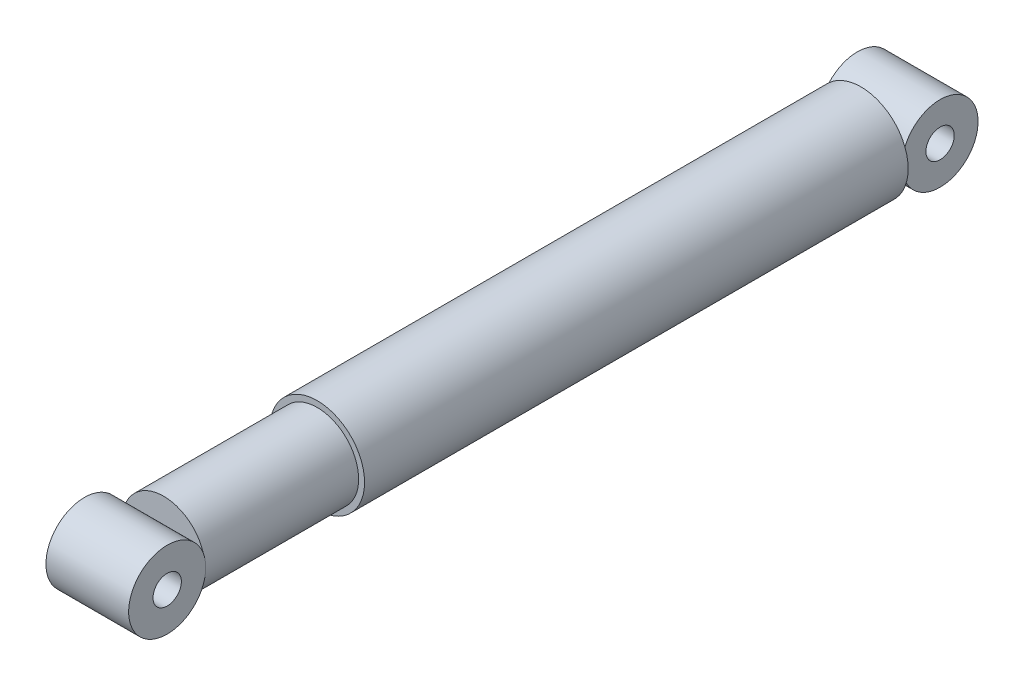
ISO-10303-21;
HEADER;
FILE_DESCRIPTION(('STEP AP214'),'2;1');
FILE_NAME('part.step','',(''),(''),'','','');
FILE_SCHEMA(('AUTOMOTIVE_DESIGN { 1 0 10303 214 1 1 1 1 }'));
ENDSEC;
DATA;
#1=APPLICATION_CONTEXT('core data for automotive mechanical design processes');
#2=APPLICATION_PROTOCOL_DEFINITION('international standard','automotive_design',2000,#1);
#3=PRODUCT_CONTEXT('',#1,'mechanical');
#4=PRODUCT('Part','Part','',(#3));
#5=PRODUCT_RELATED_PRODUCT_CATEGORY('part','',(#4));
#6=PRODUCT_DEFINITION_FORMATION('','',#4);
#7=PRODUCT_DEFINITION_CONTEXT('part definition',#1,'design');
#8=PRODUCT_DEFINITION('design','',#6,#7);
#9=PRODUCT_DEFINITION_SHAPE('','',#8);
#10=(LENGTH_UNIT() NAMED_UNIT(*) SI_UNIT(.MILLI.,.METRE.));
#11=(NAMED_UNIT(*) PLANE_ANGLE_UNIT() SI_UNIT($,.RADIAN.));
#12=(NAMED_UNIT(*) SI_UNIT($,.STERADIAN.) SOLID_ANGLE_UNIT());
#13=UNCERTAINTY_MEASURE_WITH_UNIT(LENGTH_MEASURE(1.E-05),#10,'distance_accuracy_value','');
#14=(GEOMETRIC_REPRESENTATION_CONTEXT(3) GLOBAL_UNCERTAINTY_ASSIGNED_CONTEXT((#13)) GLOBAL_UNIT_ASSIGNED_CONTEXT((#10,
#11,#12)) REPRESENTATION_CONTEXT('',''));
#15=CARTESIAN_POINT('',(0.,0.,0.));
#16=DIRECTION('',(0.,0.,1.));
#17=DIRECTION('',(1.,0.,0.));
#18=AXIS2_PLACEMENT_3D('',#15,#16,#17);
#19=CARTESIAN_POINT('',(0.,0.,295.));
#20=DIRECTION('',(0.,0.,-1.));
#21=DIRECTION('',(-1.,0.,0.));
#22=AXIS2_PLACEMENT_3D('',#19,#20,#21);
#23=PLANE('',#22);
#24=CARTESIAN_POINT('',(0.,0.,295.));
#25=DIRECTION('',(0.,0.,-1.));
#26=DIRECTION('',(-1.,0.,0.));
#27=AXIS2_PLACEMENT_3D('',#24,#25,#26);
#28=CIRCLE('',#27,17.5);
#29=CARTESIAN_POINT('',(17.2111256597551,-3.16656809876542,295.));
#30=VERTEX_POINT('',#29);
#31=CARTESIAN_POINT('',(-17.2111256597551,-3.16656809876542,295.));
#32=VERTEX_POINT('',#31);
#33=EDGE_CURVE('E139',#30,#32,#28,.T.);
#34=ORIENTED_EDGE('',*,*,#33,.F.);
#35=DIRECTION('',(-1.,0.,0.));
#36=VECTOR('',#35,1.);
#37=CARTESIAN_POINT('',(17.5,-3.16656809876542,295.));
#38=LINE('',#37,#36);
#39=EDGE_CURVE('E9',#30,#32,#38,.T.);
#40=ORIENTED_EDGE('',*,*,#39,.T.);
#41=EDGE_LOOP('',(#34,#40));
#42=FACE_BOUND('',#41,.T.);
#43=ADVANCED_FACE('F15',(#42),#23,.F.);
#44=CARTESIAN_POINT('',(0.,0.,0.));
#45=DIRECTION('',(0.,0.,-1.));
#46=DIRECTION('',(-1.,0.,0.));
#47=AXIS2_PLACEMENT_3D('',#44,#45,#46);
#48=PLANE('',#47);
#49=CARTESIAN_POINT('',(0.,0.,0.));
#50=DIRECTION('',(0.,0.,-1.));
#51=DIRECTION('',(1.,0.,0.));
#52=AXIS2_PLACEMENT_3D('',#49,#50,#51);
#53=CIRCLE('',#52,20.);
#54=CARTESIAN_POINT('',(20.,0.,0.));
#55=VERTEX_POINT('',#54);
#56=EDGE_CURVE('E144',#55,#55,#53,.T.);
#57=ORIENTED_EDGE('',*,*,#56,.T.);
#58=EDGE_LOOP('',(#57));
#59=FACE_BOUND('',#58,.T.);
#60=DIRECTION('',(-1.,0.,0.));
#61=VECTOR('',#60,1.);
#62=CARTESIAN_POINT('',(17.5,-1.5552,0.));
#63=LINE('',#62,#61);
#64=CARTESIAN_POINT('',(17.5,-1.5552,0.));
#65=VERTEX_POINT('',#64);
#66=CARTESIAN_POINT('',(-17.5,-1.5552,0.));
#67=VERTEX_POINT('',#66);
#68=EDGE_CURVE('E38',#65,#67,#63,.T.);
#69=ORIENTED_EDGE('',*,*,#68,.F.);
#70=DIRECTION('',(0.,1.,0.));
#71=VECTOR('',#70,1.);
#72=CARTESIAN_POINT('',(17.5,0.,0.));
#73=LINE('',#72,#71);
#74=CARTESIAN_POINT('',(17.5,1.5552,0.));
#75=VERTEX_POINT('',#74);
#76=EDGE_CURVE('E166',#65,#75,#73,.T.);
#77=ORIENTED_EDGE('',*,*,#76,.T.);
#78=DIRECTION('',(-1.,0.,0.));
#79=VECTOR('',#78,1.);
#80=CARTESIAN_POINT('',(17.5,1.5552,0.));
#81=LINE('',#80,#79);
#82=CARTESIAN_POINT('',(-17.5,1.5552,0.));
#83=VERTEX_POINT('',#82);
#84=EDGE_CURVE('E162',#83,#75,#81,.F.);
#85=ORIENTED_EDGE('',*,*,#84,.F.);
#86=DIRECTION('',(0.,1.,0.));
#87=VECTOR('',#86,1.);
#88=CARTESIAN_POINT('',(-17.5,0.,0.));
#89=LINE('',#88,#87);
#90=EDGE_CURVE('E159',#67,#83,#89,.T.);
#91=ORIENTED_EDGE('',*,*,#90,.F.);
#92=EDGE_LOOP('',(#69,#77,#85,#91));
#93=FACE_BOUND('',#92,.T.);
#94=ADVANCED_FACE('F131',(#59,#93),#48,.T.);
#95=CARTESIAN_POINT('',(0.,0.,230.));
#96=DIRECTION('',(0.,0.,-1.));
#97=DIRECTION('',(-1.,0.,0.));
#98=AXIS2_PLACEMENT_3D('',#95,#96,#97);
#99=CYLINDRICAL_SURFACE('',#98,20.);
#100=CARTESIAN_POINT('',(0.,0.,230.));
#101=DIRECTION('',(0.,0.,-1.));
#102=DIRECTION('',(1.,0.,0.));
#103=AXIS2_PLACEMENT_3D('',#100,#101,#102);
#104=CIRCLE('',#103,20.);
#105=CARTESIAN_POINT('',(20.,0.,230.));
#106=VERTEX_POINT('',#105);
#107=EDGE_CURVE('E156',#106,#106,#104,.T.);
#108=ORIENTED_EDGE('',*,*,#107,.T.);
#109=EDGE_LOOP('',(#108));
#110=FACE_BOUND('',#109,.T.);
#111=ORIENTED_EDGE('',*,*,#56,.F.);
#112=EDGE_LOOP('',(#111));
#113=FACE_BOUND('',#112,.T.);
#114=ADVANCED_FACE('F17',(#110,#113),#99,.T.);
#115=CARTESIAN_POINT('',(0.,0.,230.));
#116=DIRECTION('',(0.,0.,-1.));
#117=DIRECTION('',(-1.,0.,0.));
#118=AXIS2_PLACEMENT_3D('',#115,#116,#117);
#119=PLANE('',#118);
#120=CARTESIAN_POINT('',(0.,0.,230.));
#121=DIRECTION('',(0.,0.,-1.));
#122=DIRECTION('',(-1.,0.,0.));
#123=AXIS2_PLACEMENT_3D('',#120,#121,#122);
#124=CIRCLE('',#123,17.5);
#125=CARTESIAN_POINT('',(-17.5,0.,230.));
#126=VERTEX_POINT('',#125);
#127=EDGE_CURVE('E142',#126,#126,#124,.T.);
#128=ORIENTED_EDGE('',*,*,#127,.T.);
#129=EDGE_LOOP('',(#128));
#130=FACE_BOUND('',#129,.T.);
#131=ORIENTED_EDGE('',*,*,#107,.F.);
#132=EDGE_LOOP('',(#131));
#133=FACE_BOUND('',#132,.T.);
#134=ADVANCED_FACE('F129',(#130,#133),#119,.F.);
#135=CARTESIAN_POINT('',(0.,0.,295.));
#136=DIRECTION('',(0.,0.,-1.));
#137=DIRECTION('',(-1.,0.,0.));
#138=AXIS2_PLACEMENT_3D('',#135,#136,#137);
#139=CYLINDRICAL_SURFACE('',#138,17.5);
#140=CARTESIAN_POINT('',(17.2111256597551,-3.16656809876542,295.));
#141=CARTESIAN_POINT('',(17.2417640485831,-3.00004754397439,294.967042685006));
#142=CARTESIAN_POINT('',(17.2700682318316,-2.83261616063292,294.936609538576));
#143=CARTESIAN_POINT('',(17.3218989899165,-2.49615515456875,294.880898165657));
#144=CARTESIAN_POINT('',(17.3454253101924,-2.32712544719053,294.855620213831));
#145=CARTESIAN_POINT('',(17.4086766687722,-1.81794009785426,294.78767581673));
#146=CARTESIAN_POINT('',(17.4410630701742,-1.47574793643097,294.752910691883));
#147=CARTESIAN_POINT('',(17.4851242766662,-0.796144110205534,294.705620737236));
#148=CARTESIAN_POINT('',(17.4972395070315,-0.458793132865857,294.69262296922));
#149=CARTESIAN_POINT('',(17.501918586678,0.216032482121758,294.687602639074));
#150=CARTESIAN_POINT('',(17.4944915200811,0.553506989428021,294.695570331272));
#151=CARTESIAN_POINT('',(17.4578981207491,1.27201027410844,294.734840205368));
#152=CARTESIAN_POINT('',(17.4259220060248,1.65274338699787,294.769158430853));
#153=CARTESIAN_POINT('',(17.3594915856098,2.22153313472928,294.840508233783));
#154=CARTESIAN_POINT('',(17.3340460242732,2.41196057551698,294.867844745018));
#155=CARTESIAN_POINT('',(17.2770932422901,2.79083085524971,294.929056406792));
#156=CARTESIAN_POINT('',(17.2455865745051,2.97927387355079,294.962930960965));
#157=CARTESIAN_POINT('',(17.2111256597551,3.16656809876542,295.));
#158=B_SPLINE_CURVE_WITH_KNOTS('',3,(#140,#141,#142,#143,#144,#145,#146,#147,#148,#149,#150,
#151,#152,#153,#154,#155,#156,#157),.UNSPECIFIED.,.F.,.F.,(4,2,2,2,2,2,2,2,4),(0.,
0.51740620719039,1.03483997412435,2.06989251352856,3.08215000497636,4.09393703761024,
5.24284553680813,5.82482770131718,6.40675680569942),.UNSPECIFIED.);
#159=CARTESIAN_POINT('',(17.5,0.,294.689661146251));
#160=VERTEX_POINT('',#159);
#161=EDGE_CURVE('E168',#30,#160,#158,.T.);
#162=ORIENTED_EDGE('',*,*,#161,.F.);
#163=ORIENTED_EDGE('',*,*,#33,.T.);
#164=CARTESIAN_POINT('',(-17.2111256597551,3.16656809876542,295.));
#165=CARTESIAN_POINT('',(-17.2417640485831,3.00004754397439,294.967042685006));
#166=CARTESIAN_POINT('',(-17.2700682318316,2.83261616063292,294.936609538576));
#167=CARTESIAN_POINT('',(-17.3218989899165,2.49615515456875,294.880898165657));
#168=CARTESIAN_POINT('',(-17.3454253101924,2.32712544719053,294.855620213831));
#169=CARTESIAN_POINT('',(-17.4086766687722,1.81794009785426,294.78767581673));
#170=CARTESIAN_POINT('',(-17.4410630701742,1.47574793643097,294.752910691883));
#171=CARTESIAN_POINT('',(-17.4851242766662,0.796144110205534,294.705620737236));
#172=CARTESIAN_POINT('',(-17.4972395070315,0.458793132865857,294.69262296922));
#173=CARTESIAN_POINT('',(-17.501918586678,-0.216032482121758,294.687602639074));
#174=CARTESIAN_POINT('',(-17.4944915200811,-0.553506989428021,294.695570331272));
#175=CARTESIAN_POINT('',(-17.4578981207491,-1.27201027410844,294.734840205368));
#176=CARTESIAN_POINT('',(-17.4259220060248,-1.65274338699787,294.769158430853));
#177=CARTESIAN_POINT('',(-17.3594915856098,-2.22153313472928,294.840508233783));
#178=CARTESIAN_POINT('',(-17.3340460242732,-2.41196057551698,294.867844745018));
#179=CARTESIAN_POINT('',(-17.2770932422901,-2.79083085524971,294.929056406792));
#180=CARTESIAN_POINT('',(-17.2455865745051,-2.97927387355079,294.962930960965));
#181=CARTESIAN_POINT('',(-17.2111256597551,-3.16656809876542,295.));
#182=B_SPLINE_CURVE_WITH_KNOTS('',3,(#164,#165,#166,#167,#168,#169,#170,#171,#172,#173,#174,
#175,#176,#177,#178,#179,#180,#181),.UNSPECIFIED.,.F.,.F.,(4,2,2,2,2,2,2,2,4),(0.,
0.51740620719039,1.03483997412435,2.06989251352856,3.08215000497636,4.09393703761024,
5.24284553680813,5.82482770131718,6.40675680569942),.UNSPECIFIED.);
#183=CARTESIAN_POINT('',(-17.5,0.,294.689661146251));
#184=VERTEX_POINT('',#183);
#185=EDGE_CURVE('E72',#184,#32,#182,.T.);
#186=ORIENTED_EDGE('',*,*,#185,.F.);
#187=CARTESIAN_POINT('',(-17.2111256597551,3.16656809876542,295.));
#188=VERTEX_POINT('',#187);
#189=EDGE_CURVE('E62',#188,#184,#182,.T.);
#190=ORIENTED_EDGE('',*,*,#189,.F.);
#191=CARTESIAN_POINT('',(17.2111256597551,3.16656809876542,295.));
#192=VERTEX_POINT('',#191);
#193=EDGE_CURVE('E141',#188,#192,#28,.T.);
#194=ORIENTED_EDGE('',*,*,#193,.T.);
#195=EDGE_CURVE('E30',#160,#192,#158,.T.);
#196=ORIENTED_EDGE('',*,*,#195,.F.);
#197=EDGE_LOOP('',(#162,#163,#186,#190,#194,#196));
#198=FACE_BOUND('',#197,.T.);
#199=ORIENTED_EDGE('',*,*,#127,.F.);
#200=EDGE_LOOP('',(#199));
#201=FACE_BOUND('',#200,.T.);
#202=ADVANCED_FACE('F96',(#198,#201),#139,.T.);
#203=ORIENTED_EDGE('',*,*,#193,.F.);
#204=DIRECTION('',(-1.,0.,0.));
#205=VECTOR('',#204,1.);
#206=CARTESIAN_POINT('',(17.5,3.16656809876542,295.));
#207=LINE('',#206,#205);
#208=EDGE_CURVE('E23',#188,#192,#207,.F.);
#209=ORIENTED_EDGE('',*,*,#208,.T.);
#210=EDGE_LOOP('',(#203,#209));
#211=FACE_BOUND('',#210,.T.);
#212=ADVANCED_FACE('F121',(#211),#23,.F.);
#213=CARTESIAN_POINT('',(17.5,0.,-16.));
#214=DIRECTION('',(-1.,0.,0.));
#215=DIRECTION('',(0.,0.,1.));
#216=AXIS2_PLACEMENT_3D('',#213,#214,#215);
#217=CYLINDRICAL_SURFACE('',#216,16.0754050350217);
#218=CARTESIAN_POINT('',(17.5,0.,-16.));
#219=DIRECTION('',(-1.,0.,0.));
#220=DIRECTION('',(0.,1.,0.));
#221=AXIS2_PLACEMENT_3D('',#218,#219,#220);
#222=CIRCLE('',#221,16.0754050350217);
#223=EDGE_CURVE('E147',#75,#65,#222,.T.);
#224=ORIENTED_EDGE('',*,*,#223,.T.);
#225=ORIENTED_EDGE('',*,*,#68,.T.);
#226=CARTESIAN_POINT('',(-17.5,0.,-16.));
#227=DIRECTION('',(-1.,0.,0.));
#228=DIRECTION('',(0.,1.,0.));
#229=AXIS2_PLACEMENT_3D('',#226,#227,#228);
#230=CIRCLE('',#229,16.0754050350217);
#231=EDGE_CURVE('E150',#83,#67,#230,.T.);
#232=ORIENTED_EDGE('',*,*,#231,.F.);
#233=ORIENTED_EDGE('',*,*,#84,.T.);
#234=EDGE_LOOP('',(#224,#225,#232,#233));
#235=FACE_BOUND('',#234,.T.);
#236=ADVANCED_FACE('F115',(#235),#217,.T.);
#237=CARTESIAN_POINT('',(17.5,0.,-16.));
#238=DIRECTION('',(-1.,0.,0.));
#239=DIRECTION('',(0.,-1.,0.));
#240=AXIS2_PLACEMENT_3D('',#237,#238,#239);
#241=PLANE('',#240);
#242=CARTESIAN_POINT('',(17.5,0.,-16.));
#243=DIRECTION('',(1.,0.,0.));
#244=DIRECTION('',(0.,0.,1.));
#245=AXIS2_PLACEMENT_3D('',#242,#243,#244);
#246=CIRCLE('',#245,6.);
#247=CARTESIAN_POINT('',(17.5,0.,-9.99999999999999));
#248=VERTEX_POINT('',#247);
#249=EDGE_CURVE('E169',#248,#248,#246,.T.);
#250=ORIENTED_EDGE('',*,*,#249,.F.);
#251=EDGE_LOOP('',(#250));
#252=FACE_BOUND('',#251,.T.);
#253=ORIENTED_EDGE('',*,*,#76,.F.);
#254=ORIENTED_EDGE('',*,*,#223,.F.);
#255=EDGE_LOOP('',(#253,#254));
#256=FACE_BOUND('',#255,.T.);
#257=ADVANCED_FACE('F112',(#252,#256),#241,.F.);
#258=CARTESIAN_POINT('',(-17.5,0.,-16.));
#259=DIRECTION('',(-1.,0.,0.));
#260=DIRECTION('',(0.,-1.,0.));
#261=AXIS2_PLACEMENT_3D('',#258,#259,#260);
#262=PLANE('',#261);
#263=CARTESIAN_POINT('',(-17.5,0.,-16.));
#264=DIRECTION('',(-1.,0.,0.));
#265=DIRECTION('',(0.,-1.,0.));
#266=AXIS2_PLACEMENT_3D('',#263,#264,#265);
#267=CIRCLE('',#266,6.);
#268=CARTESIAN_POINT('',(-17.5,-6.,-16.));
#269=VERTEX_POINT('',#268);
#270=EDGE_CURVE('E171',#269,#269,#267,.T.);
#271=ORIENTED_EDGE('',*,*,#270,.F.);
#272=EDGE_LOOP('',(#271));
#273=FACE_BOUND('',#272,.T.);
#274=ORIENTED_EDGE('',*,*,#231,.T.);
#275=ORIENTED_EDGE('',*,*,#90,.T.);
#276=EDGE_LOOP('',(#274,#275));
#277=FACE_BOUND('',#276,.T.);
#278=ADVANCED_FACE('F110',(#273,#277),#262,.T.);
#279=CARTESIAN_POINT('',(-314.431198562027,0.,-16.));
#280=DIRECTION('',(1.,0.,0.));
#281=DIRECTION('',(0.,1.,0.));
#282=AXIS2_PLACEMENT_3D('',#279,#280,#281);
#283=CYLINDRICAL_SURFACE('',#282,6.);
#284=ORIENTED_EDGE('',*,*,#249,.T.);
#285=EDGE_LOOP('',(#284));
#286=FACE_BOUND('',#285,.T.);
#287=ORIENTED_EDGE('',*,*,#270,.T.);
#288=EDGE_LOOP('',(#287));
#289=FACE_BOUND('',#288,.T.);
#290=ADVANCED_FACE('F105',(#286,#289),#283,.F.);
#291=CARTESIAN_POINT('',(17.5,0.,311.));
#292=DIRECTION('',(-1.,0.,0.));
#293=DIRECTION('',(0.,0.,1.));
#294=AXIS2_PLACEMENT_3D('',#291,#292,#293);
#295=CYLINDRICAL_SURFACE('',#294,16.3103388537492);
#296=CARTESIAN_POINT('',(-17.5,0.,311.));
#297=DIRECTION('',(-1.,0.,0.));
#298=DIRECTION('',(0.,1.,0.));
#299=AXIS2_PLACEMENT_3D('',#296,#297,#298);
#300=CIRCLE('',#299,16.3103388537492);
#301=EDGE_CURVE('E65',#184,#184,#300,.T.);
#302=ORIENTED_EDGE('',*,*,#301,.F.);
#303=ORIENTED_EDGE('',*,*,#185,.T.);
#304=ORIENTED_EDGE('',*,*,#39,.F.);
#305=ORIENTED_EDGE('',*,*,#161,.T.);
#306=CARTESIAN_POINT('',(17.5,0.,311.));
#307=DIRECTION('',(-1.,0.,0.));
#308=DIRECTION('',(0.,1.,0.));
#309=AXIS2_PLACEMENT_3D('',#306,#307,#308);
#310=CIRCLE('',#309,16.3103388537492);
#311=EDGE_CURVE('E70',#160,#160,#310,.T.);
#312=ORIENTED_EDGE('',*,*,#311,.T.);
#313=ORIENTED_EDGE('',*,*,#195,.T.);
#314=ORIENTED_EDGE('',*,*,#208,.F.);
#315=ORIENTED_EDGE('',*,*,#189,.T.);
#316=EDGE_LOOP('',(#302,#303,#304,#305,#312,#313,#314,#315));
#317=FACE_BOUND('',#316,.T.);
#318=ADVANCED_FACE('F64',(#317),#295,.T.);
#319=CARTESIAN_POINT('',(17.5,0.,311.));
#320=DIRECTION('',(-1.,0.,0.));
#321=DIRECTION('',(0.,-1.,0.));
#322=AXIS2_PLACEMENT_3D('',#319,#320,#321);
#323=PLANE('',#322);
#324=CARTESIAN_POINT('',(17.5,0.,311.));
#325=DIRECTION('',(1.,0.,0.));
#326=DIRECTION('',(0.,0.,-1.));
#327=AXIS2_PLACEMENT_3D('',#324,#325,#326);
#328=CIRCLE('',#327,6.);
#329=CARTESIAN_POINT('',(17.5,0.,305.));
#330=VERTEX_POINT('',#329);
#331=EDGE_CURVE('E84',#330,#330,#328,.T.);
#332=ORIENTED_EDGE('',*,*,#331,.F.);
#333=EDGE_LOOP('',(#332));
#334=FACE_BOUND('',#333,.T.);
#335=ORIENTED_EDGE('',*,*,#311,.F.);
#336=EDGE_LOOP('',(#335));
#337=FACE_BOUND('',#336,.T.);
#338=ADVANCED_FACE('F104',(#334,#337),#323,.F.);
#339=CARTESIAN_POINT('',(-17.5,0.,311.));
#340=DIRECTION('',(-1.,0.,0.));
#341=DIRECTION('',(0.,-1.,0.));
#342=AXIS2_PLACEMENT_3D('',#339,#340,#341);
#343=PLANE('',#342);
#344=CARTESIAN_POINT('',(-17.5,0.,311.));
#345=DIRECTION('',(-1.,0.,0.));
#346=DIRECTION('',(0.,-1.,0.));
#347=AXIS2_PLACEMENT_3D('',#344,#345,#346);
#348=CIRCLE('',#347,6.);
#349=CARTESIAN_POINT('',(-17.5,-5.99999999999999,311.));
#350=VERTEX_POINT('',#349);
#351=EDGE_CURVE('E76',#350,#350,#348,.T.);
#352=ORIENTED_EDGE('',*,*,#351,.F.);
#353=EDGE_LOOP('',(#352));
#354=FACE_BOUND('',#353,.T.);
#355=ORIENTED_EDGE('',*,*,#301,.T.);
#356=EDGE_LOOP('',(#355));
#357=FACE_BOUND('',#356,.T.);
#358=ADVANCED_FACE('F74',(#354,#357),#343,.T.);
#359=CARTESIAN_POINT('',(-346.310545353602,0.,311.));
#360=DIRECTION('',(1.,0.,0.));
#361=DIRECTION('',(0.,1.,0.));
#362=AXIS2_PLACEMENT_3D('',#359,#360,#361);
#363=CYLINDRICAL_SURFACE('',#362,6.);
#364=ORIENTED_EDGE('',*,*,#331,.T.);
#365=EDGE_LOOP('',(#364));
#366=FACE_BOUND('',#365,.T.);
#367=ORIENTED_EDGE('',*,*,#351,.T.);
#368=EDGE_LOOP('',(#367));
#369=FACE_BOUND('',#368,.T.);
#370=ADVANCED_FACE('F197',(#366,#369),#363,.F.);
#371=CLOSED_SHELL('',(#43,#94,#114,#134,#202,#212,#236,#257,#278,#290,#318,#338,#358,#370));
#372=MANIFOLD_SOLID_BREP('B1',#371);
#373=ADVANCED_BREP_SHAPE_REPRESENTATION('',(#18,#372),#14);
#374=SHAPE_DEFINITION_REPRESENTATION(#9,#373);
ENDSEC;
END-ISO-10303-21;
